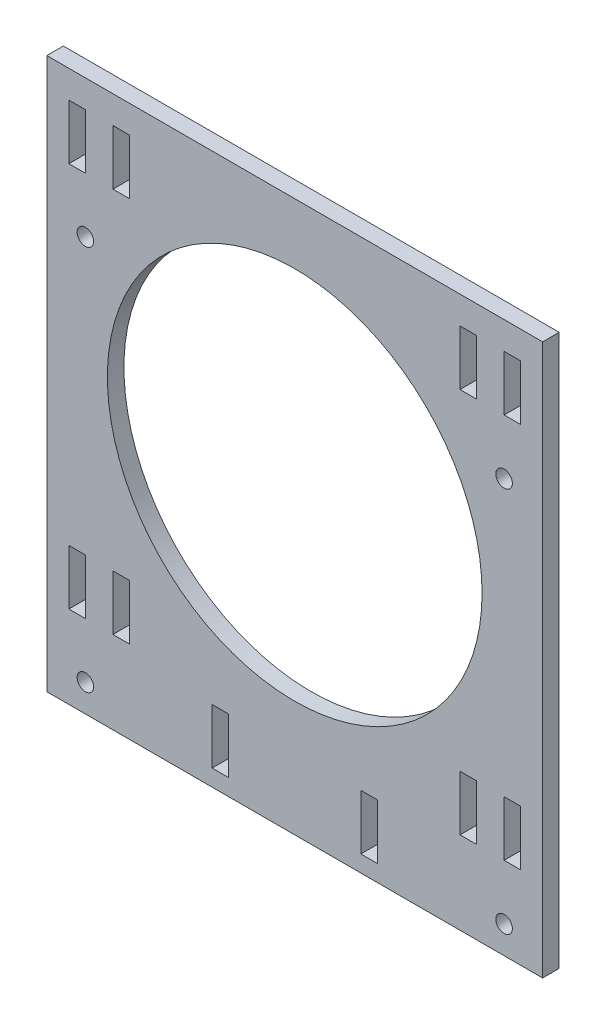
from build123d import *

# Parameters (mm, degrees)
SKETCH_3_R          = 34
EXTRUDE_2_DEPTH     = 3
SKETCH_5_W          = 3
SKETCH_5_H          = 10
CUT_EXTRUDE_2_DEPTH = 72.126647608
SKETCH_6_R          = 1.5
SKETCH_6_W          = 3
SKETCH_6_H          = 10
CUT_EXTRUDE_3_DEPTH = 10


with BuildPart() as part:
    # Sketch 3 → Extrude 2 (new body)
    with BuildSketch(Plane.XY):
        Polygon((45, 45), (-45, 45), (-45, -45), (-45, -55), (45, -55), (45, -45), align=None)
        Circle(SKETCH_3_R, mode=Mode.SUBTRACT)
    extrude(amount=EXTRUDE_2_DEPTH)

    # Sketch 5 → Cut-Extrude 2 (cut, through all)
    with BuildSketch(Plane.XY.offset(3)):
        with Locations((-31.5, 35)):
            Rectangle(SKETCH_5_W, SKETCH_5_H)
        with Locations((31.5, 35)):
            Rectangle(SKETCH_5_W, SKETCH_5_H)
        with Locations((-31.5, -35)):
            Rectangle(SKETCH_5_W, SKETCH_5_H)
        with Locations((31.5, -35)):
            Rectangle(SKETCH_5_W, SKETCH_5_H)
    extrude(amount=-CUT_EXTRUDE_2_DEPTH, mode=Mode.SUBTRACT)

    # Sketch 6 → Cut-Extrude 3 (cut)
    with BuildSketch(Plane.XY.offset(3)):
        with Locations((-38, -50)):
            Circle(SKETCH_6_R)
        with Locations((-38, 20)):
            Circle(SKETCH_6_R)
        with Locations((38, 20)):
            Circle(SKETCH_6_R)
        with Locations((38, -50)):
            Circle(SKETCH_6_R)
        with Locations((-39.5, -35)):
            Rectangle(SKETCH_6_W, SKETCH_6_H)
        with Locations((-39.5, 35)):
            Rectangle(SKETCH_6_W, SKETCH_6_H)
        with Locations((-13.5, -47)):
            Rectangle(SKETCH_6_W, SKETCH_6_H)
        with Locations((13.5, -47)):
            Rectangle(SKETCH_6_W, SKETCH_6_H)
        with Locations((39.5, 35)):
            Rectangle(SKETCH_6_W, SKETCH_6_H)
        with Locations((39.5, -35)):
            Rectangle(SKETCH_6_W, SKETCH_6_H)
    extrude(amount=-CUT_EXTRUDE_3_DEPTH, mode=Mode.SUBTRACT)


solid = part.part
